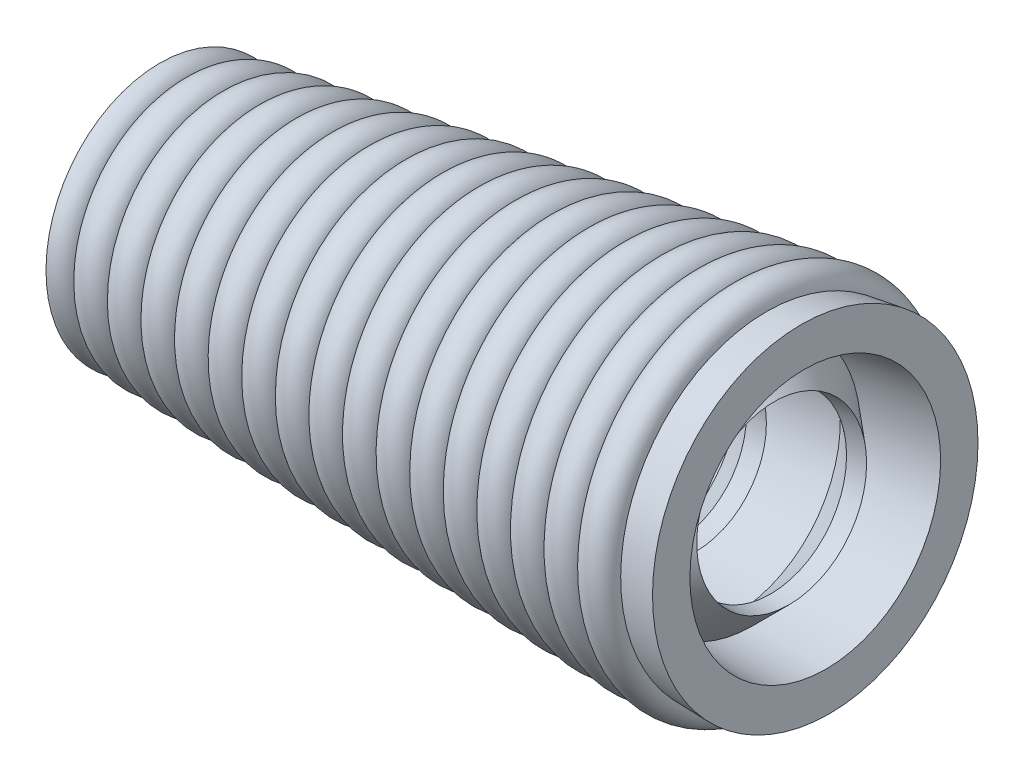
from build123d import *


with BuildPart() as part:
    # Sketch1 → Revolve2 (revolve)
    with BuildSketch(Plane.XY):
        with BuildLine():
            Line((0, 0), (6.35, -6.35))
            Line((6.35, -6.35), (50.8, -6.35))
            ThreePointArc((50.8, -6.35), (53.975, -9.525), (57.15, -6.35))
            ThreePointArc((57.15, -6.35), (60.325, -9.525), (63.5, -6.35))
            ThreePointArc((63.5, -6.35), (66.675, -9.525), (69.85, -6.35))
            ThreePointArc((69.85, -6.35), (73.025, -9.525), (76.2, -6.35))
            ThreePointArc((76.2, -6.35), (79.375, -9.525), (82.55, -6.35))
            ThreePointArc((82.55, -6.35), (85.725, -9.525), (88.9, -6.35))
            ThreePointArc((88.9, -6.35), (92.075, -9.525), (95.25, -6.35))
            ThreePointArc((95.25, -6.35), (98.425, -9.525), (101.6, -6.35))
            ThreePointArc((101.6, -6.35), (104.775, -9.525), (107.95, -6.35))
            ThreePointArc((107.95, -6.35), (111.125, -9.525), (114.3, -6.35))
            ThreePointArc((114.3, -6.35), (117.475, -9.525), (120.65, -6.35))
            ThreePointArc((120.65, -6.35), (123.825, -9.525), (127, -6.35))
            ThreePointArc((127, -6.35), (130.175, -9.525), (133.35, -6.35))
            ThreePointArc((133.35, -6.35), (136.525, -9.525), (139.7, -6.35))
            ThreePointArc((139.7, -6.35), (142.875, -9.525), (146.05, -6.35))
            ThreePointArc((146.05, -6.35), (149.225, -9.525), (152.4, -6.35))
            ThreePointArc((152.4, -6.35), (155.575, -9.525), (158.75, -6.35))
            ThreePointArc((158.75, -6.35), (161.925, -9.525), (165.1, -6.35))
            ThreePointArc((165.1, -6.35), (168.275, -9.525), (171.45, -6.35))
            ThreePointArc((171.45, -6.35), (174.625, -9.525), (177.8, -6.35))
            ThreePointArc((177.8, -6.35), (180.975, -9.525), (184.15, -6.35))
            ThreePointArc((184.15, -6.35), (187.325, -9.525), (190.5, -6.35))
            ThreePointArc((190.5, -6.35), (193.675, -9.525), (196.85, -6.35))
            ThreePointArc((196.85, -6.35), (200.025, -9.525), (203.2, -6.35))
            Line((203.2, -6.35), (292.1, -6.35))
            Line((292.1, -6.35), (304.8, -1.111106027))
            Line((304.8, -1.111106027), (292.1, 0))
            Line((292.1, 0), (259.461664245, 0))
            Line((259.461664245, 0), (265.811664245, 6.35))
            Line((265.811664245, 6.35), (262.636664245, 6.35))
            Line((262.636664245, 6.35), (256.286664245, 0))
            Line((256.286664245, 0), (243.586664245, 0))
            Line((243.586664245, 0), (249.936664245, 6.35))
            Line((249.936664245, 6.35), (246.761664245, 6.35))
            Line((246.761664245, 6.35), (240.411664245, 0))
            Line((240.411664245, 0), (227.711664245, 0))
            Line((227.711664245, 0), (234.061664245, 6.35))
            Line((234.061664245, 6.35), (230.886664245, 6.35))
            Line((230.886664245, 6.35), (224.536664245, 0))
            Line((224.536664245, 0), (211.836664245, 0))
            Line((211.836664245, 0), (218.186664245, 6.35))
            Line((218.186664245, 6.35), (215.011664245, 6.35))
            Line((215.011664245, 6.35), (208.661664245, 0))
            Line((208.661664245, 0), (195.961664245, 0))
            Line((195.961664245, 0), (202.311664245, 6.35))
            Line((202.311664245, 6.35), (199.136664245, 6.35))
            Line((199.136664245, 6.35), (192.786664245, 0))
            Line((192.786664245, 0), (180.086664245, 0))
            Line((180.086664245, 0), (186.436664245, 6.35))
            Line((186.436664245, 6.35), (183.261664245, 6.35))
            Line((183.261664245, 6.35), (176.911664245, 0))
            Line((176.911664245, 0), (164.211664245, 0))
            Line((164.211664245, 0), (170.561664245, 6.35))
            Line((170.561664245, 6.35), (167.386664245, 6.35))
            Line((167.386664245, 6.35), (161.036664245, 0))
            Line((161.036664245, 0), (148.336664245, 0))
            Line((148.336664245, 0), (154.686664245, 6.35))
            Line((154.686664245, 6.35), (151.511664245, 6.35))
            Line((151.511664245, 6.35), (145.161664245, 0))
            Line((145.161664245, 0), (132.461664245, 0))
            Line((132.461664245, 0), (138.811664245, 6.35))
            Line((138.811664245, 6.35), (135.636664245, 6.35))
            Line((135.636664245, 6.35), (129.286664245, 0))
            Line((129.286664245, 0), (116.586664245, 0))
            Line((116.586664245, 0), (122.936664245, 6.35))
            Line((122.936664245, 6.35), (119.761664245, 6.35))
            Line((119.761664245, 6.35), (113.411664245, 0))
            Line((113.411664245, 0), (100.711664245, 0))
            Line((100.711664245, 0), (107.061664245, 6.35))
            Line((107.061664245, 6.35), (103.886664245, 6.35))
            Line((103.886664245, 6.35), (97.536664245, 0))
            Line((97.536664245, 0), (0, 0))
        make_face()
    revolve(axis=Axis((29.791985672, 5.793588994, 0), (0.9961946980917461, 0.08715574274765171, 0)))

    # SurfaceCut4
    split(bisect_by=Plane(origin=(96.795763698, 8.468532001, 0), x_dir=(0, 0, -1), z_dir=(0.9961946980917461, 0.08715574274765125, 0)), keep=Keep.TOP)

    # SurfaceCut5
    split(bisect_by=Plane(origin=(207.076644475, 18.116858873, 0), x_dir=(0, 0, -1), z_dir=(0.9961946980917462, 0.08715574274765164, 0)), keep=Keep.BOTTOM)


solid = part.part
